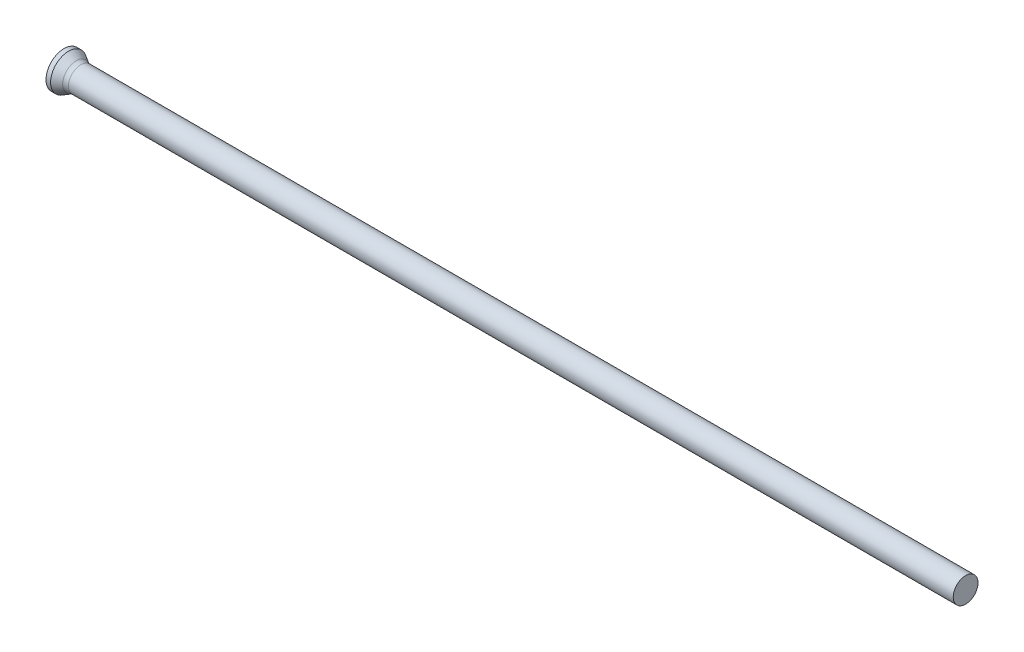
ISO-10303-21;
HEADER;
FILE_DESCRIPTION(('STEP AP214'),'2;1');
FILE_NAME('part.step','',(''),(''),'','','');
FILE_SCHEMA(('AUTOMOTIVE_DESIGN { 1 0 10303 214 1 1 1 1 }'));
ENDSEC;
DATA;
#1=APPLICATION_CONTEXT('core data for automotive mechanical design processes');
#2=APPLICATION_PROTOCOL_DEFINITION('international standard','automotive_design',2000,#1);
#3=PRODUCT_CONTEXT('',#1,'mechanical');
#4=PRODUCT('Part','Part','',(#3));
#5=PRODUCT_RELATED_PRODUCT_CATEGORY('part','',(#4));
#6=PRODUCT_DEFINITION_FORMATION('','',#4);
#7=PRODUCT_DEFINITION_CONTEXT('part definition',#1,'design');
#8=PRODUCT_DEFINITION('design','',#6,#7);
#9=PRODUCT_DEFINITION_SHAPE('','',#8);
#10=(LENGTH_UNIT() NAMED_UNIT(*) SI_UNIT(.MILLI.,.METRE.));
#11=(NAMED_UNIT(*) PLANE_ANGLE_UNIT() SI_UNIT($,.RADIAN.));
#12=(NAMED_UNIT(*) SI_UNIT($,.STERADIAN.) SOLID_ANGLE_UNIT());
#13=UNCERTAINTY_MEASURE_WITH_UNIT(LENGTH_MEASURE(1.E-05),#10,'distance_accuracy_value','');
#14=(GEOMETRIC_REPRESENTATION_CONTEXT(3) GLOBAL_UNCERTAINTY_ASSIGNED_CONTEXT((#13)) GLOBAL_UNIT_ASSIGNED_CONTEXT((#10,
#11,#12)) REPRESENTATION_CONTEXT('',''));
#15=CARTESIAN_POINT('',(0.,0.,0.));
#16=DIRECTION('',(0.,0.,1.));
#17=DIRECTION('',(1.,0.,0.));
#18=AXIS2_PLACEMENT_3D('',#15,#16,#17);
#19=CARTESIAN_POINT('',(0.,0.,0.));
#20=DIRECTION('',(1.,0.,0.));
#21=DIRECTION('',(0.,0.,-1.));
#22=AXIS2_PLACEMENT_3D('',#19,#20,#21);
#23=PLANE('',#22);
#24=CARTESIAN_POINT('',(0.,0.,0.));
#25=DIRECTION('',(-1.,0.,0.));
#26=DIRECTION('',(0.,0.,1.));
#27=AXIS2_PLACEMENT_3D('',#24,#25,#26);
#28=CIRCLE('',#27,2.);
#29=CARTESIAN_POINT('',(0.,0.,2.));
#30=VERTEX_POINT('',#29);
#31=EDGE_CURVE('E25',#30,#30,#28,.T.);
#32=ORIENTED_EDGE('',*,*,#31,.T.);
#33=EDGE_LOOP('',(#32));
#34=FACE_BOUND('',#33,.T.);
#35=ADVANCED_FACE('F14',(#34),#23,.F.);
#36=CARTESIAN_POINT('',(0.,0.,0.));
#37=DIRECTION('',(-1.,0.,0.));
#38=DIRECTION('',(0.,0.,1.));
#39=AXIS2_PLACEMENT_3D('',#36,#37,#38);
#40=CYLINDRICAL_SURFACE('',#39,2.);
#41=ORIENTED_EDGE('',*,*,#31,.F.);
#42=EDGE_LOOP('',(#41));
#43=FACE_BOUND('',#42,.T.);
#44=CARTESIAN_POINT('',(0.507468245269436,0.,0.));
#45=DIRECTION('',(-1.,0.,0.));
#46=DIRECTION('',(0.,0.,1.));
#47=AXIS2_PLACEMENT_3D('',#44,#45,#46);
#48=CIRCLE('',#47,2.);
#49=CARTESIAN_POINT('',(0.507468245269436,0.,2.));
#50=VERTEX_POINT('',#49);
#51=EDGE_CURVE('E29',#50,#50,#48,.T.);
#52=ORIENTED_EDGE('',*,*,#51,.T.);
#53=EDGE_LOOP('',(#52));
#54=FACE_BOUND('',#53,.T.);
#55=ADVANCED_FACE('F53',(#43,#54),#40,.T.);
#56=CARTESIAN_POINT('',(1.59,0.,0.));
#57=DIRECTION('',(-1.,0.,0.));
#58=DIRECTION('',(0.,0.,1.));
#59=AXIS2_PLACEMENT_3D('',#56,#57,#58);
#60=CONICAL_SURFACE('',#59,1.375,0.523598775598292);
#61=CARTESIAN_POINT('',(1.35794919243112,0.,0.));
#62=DIRECTION('',(-1.,0.,0.));
#63=DIRECTION('',(0.,0.,1.));
#64=AXIS2_PLACEMENT_3D('',#61,#62,#63);
#65=CIRCLE('',#64,1.50897459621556);
#66=CARTESIAN_POINT('',(1.35794919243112,0.,1.50897459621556));
#67=VERTEX_POINT('',#66);
#68=EDGE_CURVE('E21',#67,#67,#65,.T.);
#69=ORIENTED_EDGE('',*,*,#68,.T.);
#70=EDGE_LOOP('',(#69));
#71=FACE_BOUND('',#70,.T.);
#72=ORIENTED_EDGE('',*,*,#51,.F.);
#73=EDGE_LOOP('',(#72));
#74=FACE_BOUND('',#73,.T.);
#75=ADVANCED_FACE('F50',(#71,#74),#60,.T.);
#76=CARTESIAN_POINT('',(0.,0.,0.));
#77=DIRECTION('',(-1.,0.,0.));
#78=DIRECTION('',(0.,0.,1.));
#79=AXIS2_PLACEMENT_3D('',#76,#77,#78);
#80=CYLINDRICAL_SURFACE('',#79,1.375);
#81=CARTESIAN_POINT('',(1.85794919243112,0.,0.));
#82=DIRECTION('',(-1.,0.,0.));
#83=DIRECTION('',(0.,0.,1.));
#84=AXIS2_PLACEMENT_3D('',#81,#82,#83);
#85=CIRCLE('',#84,1.375);
#86=CARTESIAN_POINT('',(1.85794919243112,0.,1.375));
#87=VERTEX_POINT('',#86);
#88=EDGE_CURVE('E9',#87,#87,#85,.F.);
#89=ORIENTED_EDGE('',*,*,#88,.T.);
#90=EDGE_LOOP('',(#89));
#91=FACE_BOUND('',#90,.T.);
#92=CARTESIAN_POINT('',(100.,0.,0.));
#93=DIRECTION('',(-1.,0.,0.));
#94=DIRECTION('',(0.,0.,1.));
#95=AXIS2_PLACEMENT_3D('',#92,#93,#94);
#96=CIRCLE('',#95,1.375);
#97=CARTESIAN_POINT('',(100.,0.,1.375));
#98=VERTEX_POINT('',#97);
#99=EDGE_CURVE('E34',#98,#98,#96,.T.);
#100=ORIENTED_EDGE('',*,*,#99,.T.);
#101=EDGE_LOOP('',(#100));
#102=FACE_BOUND('',#101,.T.);
#103=ADVANCED_FACE('F38',(#91,#102),#80,.T.);
#104=CARTESIAN_POINT('',(100.,1.375,0.));
#105=DIRECTION('',(-1.,0.,0.));
#106=DIRECTION('',(0.,0.,1.));
#107=AXIS2_PLACEMENT_3D('',#104,#105,#106);
#108=PLANE('',#107);
#109=ORIENTED_EDGE('',*,*,#99,.F.);
#110=EDGE_LOOP('',(#109));
#111=FACE_BOUND('',#110,.T.);
#112=ADVANCED_FACE('F40',(#111),#108,.F.);
#113=CARTESIAN_POINT('',(1.85794919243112,0.,0.));
#114=DIRECTION('',(-1.,0.,0.));
#115=DIRECTION('',(0.,0.,1.));
#116=AXIS2_PLACEMENT_3D('',#113,#114,#115);
#117=TOROIDAL_SURFACE('',#116,2.375,1.);
#118=ORIENTED_EDGE('',*,*,#88,.F.);
#119=EDGE_LOOP('',(#118));
#120=FACE_BOUND('',#119,.T.);
#121=ORIENTED_EDGE('',*,*,#68,.F.);
#122=EDGE_LOOP('',(#121));
#123=FACE_BOUND('',#122,.T.);
#124=ADVANCED_FACE('F16',(#120,#123),#117,.F.);
#125=CLOSED_SHELL('',(#35,#55,#75,#103,#112,#124));
#126=MANIFOLD_SOLID_BREP('B1',#125);
#127=ADVANCED_BREP_SHAPE_REPRESENTATION('',(#18,#126),#14);
#128=SHAPE_DEFINITION_REPRESENTATION(#9,#127);
ENDSEC;
END-ISO-10303-21;
